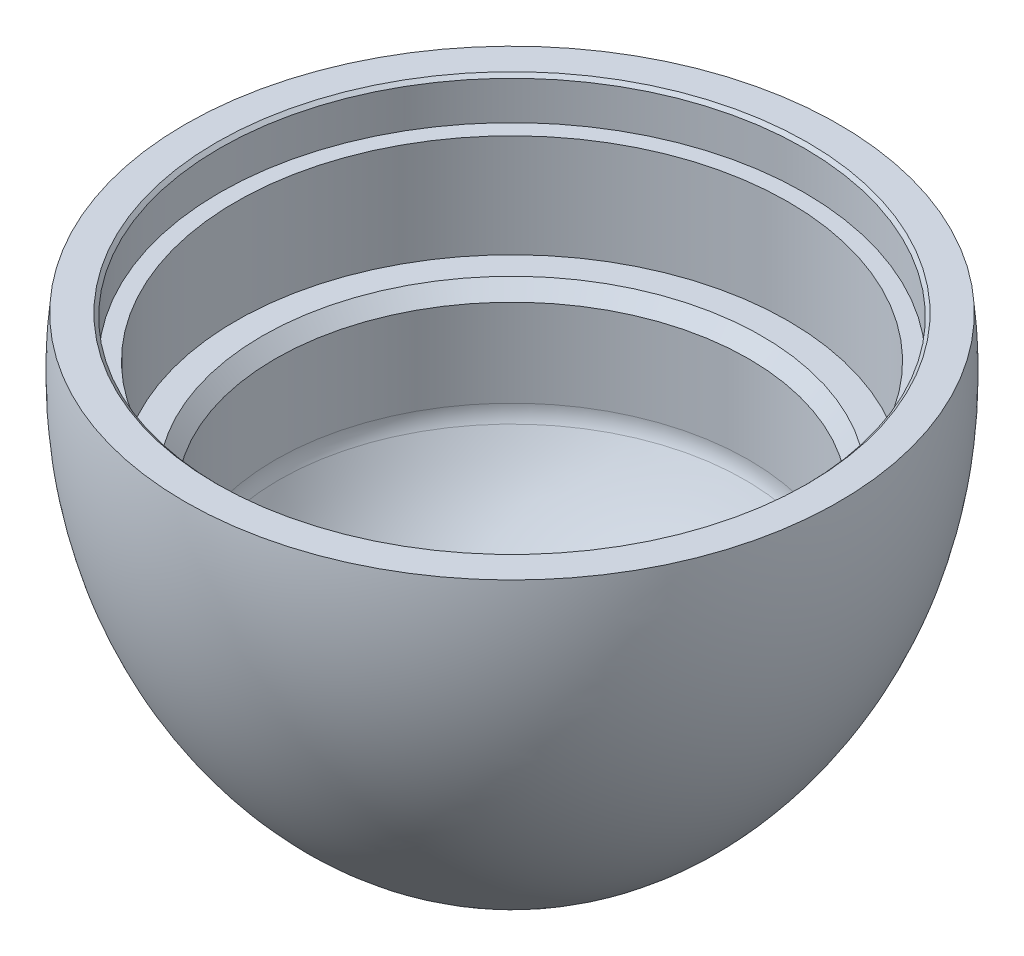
ISO-10303-21;
HEADER;
FILE_DESCRIPTION(('STEP AP214'),'2;1');
FILE_NAME('part.step','',(''),(''),'','','');
FILE_SCHEMA(('AUTOMOTIVE_DESIGN { 1 0 10303 214 1 1 1 1 }'));
ENDSEC;
DATA;
#1=APPLICATION_CONTEXT('core data for automotive mechanical design processes');
#2=APPLICATION_PROTOCOL_DEFINITION('international standard','automotive_design',2000,#1);
#3=PRODUCT_CONTEXT('',#1,'mechanical');
#4=PRODUCT('Part','Part','',(#3));
#5=PRODUCT_RELATED_PRODUCT_CATEGORY('part','',(#4));
#6=PRODUCT_DEFINITION_FORMATION('','',#4);
#7=PRODUCT_DEFINITION_CONTEXT('part definition',#1,'design');
#8=PRODUCT_DEFINITION('design','',#6,#7);
#9=PRODUCT_DEFINITION_SHAPE('','',#8);
#10=(LENGTH_UNIT() NAMED_UNIT(*) SI_UNIT(.MILLI.,.METRE.));
#11=(NAMED_UNIT(*) PLANE_ANGLE_UNIT() SI_UNIT($,.RADIAN.));
#12=(NAMED_UNIT(*) SI_UNIT($,.STERADIAN.) SOLID_ANGLE_UNIT());
#13=UNCERTAINTY_MEASURE_WITH_UNIT(LENGTH_MEASURE(1.E-05),#10,'distance_accuracy_value','');
#14=(GEOMETRIC_REPRESENTATION_CONTEXT(3) GLOBAL_UNCERTAINTY_ASSIGNED_CONTEXT((#13)) GLOBAL_UNIT_ASSIGNED_CONTEXT((#10,
#11,#12)) REPRESENTATION_CONTEXT('',''));
#15=CARTESIAN_POINT('',(0.,0.,0.));
#16=DIRECTION('',(0.,0.,1.));
#17=DIRECTION('',(1.,0.,0.));
#18=AXIS2_PLACEMENT_3D('',#15,#16,#17);
#19=CARTESIAN_POINT('',(0.,-72.41296971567,-0.000217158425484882));
#20=DIRECTION('',(0.,1.,0.));
#21=DIRECTION('',(0.,0.,1.));
#22=AXIS2_PLACEMENT_3D('',#19,#20,#21);
#23=CYLINDRICAL_SURFACE('',#22,21.);
#24=CARTESIAN_POINT('',(0.,-3.175,-0.000217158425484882));
#25=DIRECTION('',(0.,-1.,0.));
#26=DIRECTION('',(0.,0.,-1.));
#27=AXIS2_PLACEMENT_3D('',#24,#25,#26);
#28=CIRCLE('',#27,21.);
#29=CARTESIAN_POINT('',(0.,-3.175,-21.0002171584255));
#30=VERTEX_POINT('',#29);
#31=EDGE_CURVE('E76',#30,#30,#28,.F.);
#32=ORIENTED_EDGE('',*,*,#31,.T.);
#33=EDGE_LOOP('',(#32));
#34=FACE_BOUND('',#33,.T.);
#35=CARTESIAN_POINT('',(0.,-11.008000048,-0.000217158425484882));
#36=DIRECTION('',(0.,1.,0.));
#37=DIRECTION('',(0.,0.,1.));
#38=AXIS2_PLACEMENT_3D('',#35,#36,#37);
#39=CIRCLE('',#38,21.);
#40=CARTESIAN_POINT('',(0.,-11.008000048,20.9997828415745));
#41=VERTEX_POINT('',#40);
#42=EDGE_CURVE('E70',#41,#41,#39,.F.);
#43=ORIENTED_EDGE('',*,*,#42,.T.);
#44=EDGE_LOOP('',(#43));
#45=FACE_BOUND('',#44,.T.);
#46=ADVANCED_FACE('F49',(#34,#45),#23,.F.);
#47=CARTESIAN_POINT('',(0.,-11.008000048,0.));
#48=DIRECTION('',(0.,1.,0.));
#49=DIRECTION('',(0.,0.,1.));
#50=AXIS2_PLACEMENT_3D('',#47,#48,#49);
#51=PLANE('',#50);
#52=CARTESIAN_POINT('',(0.,-11.008000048,0.));
#53=DIRECTION('',(0.,1.,0.));
#54=DIRECTION('',(0.,0.,1.));
#55=AXIS2_PLACEMENT_3D('',#52,#53,#54);
#56=CIRCLE('',#55,19.);
#57=CARTESIAN_POINT('',(0.,-11.008000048,19.));
#58=VERTEX_POINT('',#57);
#59=EDGE_CURVE('E73',#58,#58,#56,.F.);
#60=ORIENTED_EDGE('',*,*,#59,.T.);
#61=EDGE_LOOP('',(#60));
#62=FACE_BOUND('',#61,.T.);
#63=ORIENTED_EDGE('',*,*,#42,.F.);
#64=EDGE_LOOP('',(#63));
#65=FACE_BOUND('',#64,.T.);
#66=ADVANCED_FACE('F114',(#62,#65),#51,.T.);
#67=CARTESIAN_POINT('',(0.,-31.328000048,0.));
#68=DIRECTION('',(0.,-1.,0.));
#69=DIRECTION('',(1.,0.,0.));
#70=AXIS2_PLACEMENT_3D('',#67,#68,#69);
#71=PLANE('',#70);
#72=CARTESIAN_POINT('',(0.,-31.328000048,0.));
#73=DIRECTION('',(0.,-1.,0.));
#74=DIRECTION('',(1.,0.,0.));
#75=AXIS2_PLACEMENT_3D('',#72,#73,#74);
#76=CIRCLE('',#75,5.86616805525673);
#77=CARTESIAN_POINT('',(5.86616805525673,-31.328000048,0.));
#78=VERTEX_POINT('',#77);
#79=EDGE_CURVE('E88',#78,#78,#76,.F.);
#80=ORIENTED_EDGE('',*,*,#79,.T.);
#81=EDGE_LOOP('',(#80));
#82=FACE_BOUND('',#81,.T.);
#83=ADVANCED_FACE('F120',(#82),#71,.F.);
#84=CARTESIAN_POINT('',(0.,0.,0.));
#85=DIRECTION('',(0.,1.,0.));
#86=DIRECTION('',(-1.,0.,0.));
#87=AXIS2_PLACEMENT_3D('',#84,#85,#86);
#88=CYLINDRICAL_SURFACE('',#87,18.);
#89=CARTESIAN_POINT('',(0.,-18.6582076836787,0.));
#90=DIRECTION('',(0.,1.,0.));
#91=DIRECTION('',(-1.,0.,0.));
#92=AXIS2_PLACEMENT_3D('',#89,#90,#91);
#93=CIRCLE('',#92,18.);
#94=CARTESIAN_POINT('',(-18.,-18.6582076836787,0.));
#95=VERTEX_POINT('',#94);
#96=EDGE_CURVE('E97',#95,#95,#93,.F.);
#97=ORIENTED_EDGE('',*,*,#96,.T.);
#98=EDGE_LOOP('',(#97));
#99=FACE_BOUND('',#98,.T.);
#100=CARTESIAN_POINT('',(0.,-12.008000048,0.));
#101=DIRECTION('',(0.,1.,0.));
#102=DIRECTION('',(-1.,0.,0.));
#103=AXIS2_PLACEMENT_3D('',#100,#101,#102);
#104=CIRCLE('',#103,18.);
#105=CARTESIAN_POINT('',(-18.,-12.008000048,0.));
#106=VERTEX_POINT('',#105);
#107=EDGE_CURVE('E69',#106,#106,#104,.T.);
#108=ORIENTED_EDGE('',*,*,#107,.T.);
#109=EDGE_LOOP('',(#108));
#110=FACE_BOUND('',#109,.T.);
#111=ADVANCED_FACE('F142',(#99,#110),#88,.F.);
#112=CARTESIAN_POINT('',(-18.,-19.2702737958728,0.));
#113=CARTESIAN_POINT('',(-16.1830574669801,-22.8809160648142,0.));
#114=CARTESIAN_POINT('',(-14.257330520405,-25.1788176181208,0.));
#115=CARTESIAN_POINT('',(-7.84861420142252,-30.8462309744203,0.));
#116=CARTESIAN_POINT('',(-6.35,-31.328000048,0.));
#117=B_SPLINE_CURVE_WITH_KNOTS('',3,(#112,#113,#114,#115,#116),.UNSPECIFIED.,.F.,.F.,(4,1,4),
(0.191160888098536,0.55885345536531,0.707021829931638),.UNSPECIFIED.);
#118=CARTESIAN_POINT('',(0.,0.,0.));
#119=DIRECTION('',(0.,1.,0.));
#120=AXIS1_PLACEMENT('',#118,#119);
#121=SURFACE_OF_REVOLUTION('',#117,#120);
#122=CARTESIAN_POINT('',(0.,-31.0732392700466,0.));
#123=DIRECTION('',(0.,1.,0.));
#124=DIRECTION('',(-1.,0.,0.));
#125=AXIS2_PLACEMENT_3D('',#122,#123,#124);
#126=CIRCLE('',#125,6.97489782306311);
#127=CARTESIAN_POINT('',(-6.97489782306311,-31.0732392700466,0.));
#128=VERTEX_POINT('',#127);
#129=EDGE_CURVE('E94',#128,#128,#126,.F.);
#130=ORIENTED_EDGE('',*,*,#129,.T.);
#131=EDGE_LOOP('',(#130));
#132=FACE_BOUND('',#131,.T.);
#133=CARTESIAN_POINT('',(0.,-19.8320000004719,0.));
#134=DIRECTION('',(0.,1.,0.));
#135=DIRECTION('',(-1.,0.,0.));
#136=AXIS2_PLACEMENT_3D('',#133,#134,#135);
#137=CIRCLE('',#136,17.7125122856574);
#138=CARTESIAN_POINT('',(-17.7125122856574,-19.8320000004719,0.));
#139=VERTEX_POINT('',#138);
#140=EDGE_CURVE('E91',#139,#139,#137,.T.);
#141=ORIENTED_EDGE('',*,*,#140,.T.);
#142=EDGE_LOOP('',(#141));
#143=FACE_BOUND('',#142,.T.);
#144=ADVANCED_FACE('F146',(#132,#143),#121,.T.);
#145=CARTESIAN_POINT('',(0.,-3.175,22.225));
#146=DIRECTION('',(0.,-1.,0.));
#147=DIRECTION('',(0.,0.,-1.));
#148=AXIS2_PLACEMENT_3D('',#145,#146,#147);
#149=PLANE('',#148);
#150=CARTESIAN_POINT('',(0.,-3.175,0.));
#151=DIRECTION('',(0.,1.,0.));
#152=DIRECTION('',(0.,0.,1.));
#153=AXIS2_PLACEMENT_3D('',#150,#151,#152);
#154=CIRCLE('',#153,22.225);
#155=CARTESIAN_POINT('',(0.,-3.175,22.225));
#156=VERTEX_POINT('',#155);
#157=EDGE_CURVE('E84',#156,#156,#154,.T.);
#158=ORIENTED_EDGE('',*,*,#157,.T.);
#159=EDGE_LOOP('',(#158));
#160=FACE_BOUND('',#159,.T.);
#161=ORIENTED_EDGE('',*,*,#31,.F.);
#162=EDGE_LOOP('',(#161));
#163=FACE_BOUND('',#162,.T.);
#164=ADVANCED_FACE('F153',(#160,#163),#149,.F.);
#165=CARTESIAN_POINT('',(0.,0.,0.));
#166=DIRECTION('',(0.,1.,0.));
#167=DIRECTION('',(0.,0.,1.));
#168=AXIS2_PLACEMENT_3D('',#165,#166,#167);
#169=CYLINDRICAL_SURFACE('',#168,22.225);
#170=CARTESIAN_POINT('',(0.,-0.253999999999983,0.));
#171=DIRECTION('',(0.,1.,0.));
#172=DIRECTION('',(0.,0.,1.));
#173=AXIS2_PLACEMENT_3D('',#170,#171,#172);
#174=CIRCLE('',#173,22.225);
#175=CARTESIAN_POINT('',(0.,-0.253999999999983,22.225));
#176=VERTEX_POINT('',#175);
#177=EDGE_CURVE('E56',#176,#176,#174,.T.);
#178=ORIENTED_EDGE('',*,*,#177,.T.);
#179=EDGE_LOOP('',(#178));
#180=FACE_BOUND('',#179,.T.);
#181=ORIENTED_EDGE('',*,*,#157,.F.);
#182=EDGE_LOOP('',(#181));
#183=FACE_BOUND('',#182,.T.);
#184=ADVANCED_FACE('F63',(#180,#183),#169,.F.);
#185=CARTESIAN_POINT('',(0.,34.942963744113,-0.000217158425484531));
#186=CARTESIAN_POINT('',(-2.47002074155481,34.942963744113,-0.000217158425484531));
#187=CARTESIAN_POINT('',(-8.1811993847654,33.2171120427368,-0.000217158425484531));
#188=CARTESIAN_POINT('',(-15.9799569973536,25.0760591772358,-0.000217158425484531));
#189=CARTESIAN_POINT('',(-20.1961269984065,17.6638092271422,-0.000217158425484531));
#190=CARTESIAN_POINT('',(-26.4159810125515,-0.462030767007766,-0.000217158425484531));
#191=CARTESIAN_POINT('',(-23.3812586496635,-22.2961421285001,-0.000217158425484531));
#192=CARTESIAN_POINT('',(-9.55475702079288,-34.8978097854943,-0.000217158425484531));
#193=CARTESIAN_POINT('',(0.,-34.551436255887,-0.000217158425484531));
#194=B_SPLINE_CURVE_WITH_KNOTS('',3,(#185,#186,#187,#188,#189,#190,#191,#192,#193),
.UNSPECIFIED.,.F.,.F.,(4,1,1,1,1,1,4),(0.,0.0971267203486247,0.127738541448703,
0.306118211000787,0.478065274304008,0.702770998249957,1.),.UNSPECIFIED.);
#195=CARTESIAN_POINT('',(0.,61.3915939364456,-0.000217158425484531));
#196=DIRECTION('',(0.,1.,0.));
#197=AXIS1_PLACEMENT('',#195,#196);
#198=SURFACE_OF_REVOLUTION('',#194,#197);
#199=CARTESIAN_POINT('',(0.,-34.551436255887,-0.000217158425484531));
#200=VERTEX_POINT('',#199);
#201=VERTEX_LOOP('',#200);
#202=FACE_BOUND('',#201,.T.);
#203=CARTESIAN_POINT('',(0.,0.,-0.000217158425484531));
#204=DIRECTION('',(0.,1.,0.));
#205=DIRECTION('',(0.,0.,1.));
#206=AXIS2_PLACEMENT_3D('',#203,#204,#205);
#207=CIRCLE('',#206,24.8562743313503);
#208=CARTESIAN_POINT('',(0.,0.,24.8560571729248));
#209=VERTEX_POINT('',#208);
#210=EDGE_CURVE('E67',#209,#209,#207,.F.);
#211=ORIENTED_EDGE('',*,*,#210,.T.);
#212=EDGE_LOOP('',(#211));
#213=FACE_BOUND('',#212,.T.);
#214=ADVANCED_FACE('F59',(#202,#213),#198,.F.);
#215=CARTESIAN_POINT('',(0.,0.,0.));
#216=DIRECTION('',(0.,1.,0.));
#217=DIRECTION('',(0.,0.,1.));
#218=AXIS2_PLACEMENT_3D('',#215,#216,#217);
#219=PLANE('',#218);
#220=CARTESIAN_POINT('',(0.,0.,0.));
#221=DIRECTION('',(0.,1.,0.));
#222=DIRECTION('',(0.,0.,1.));
#223=AXIS2_PLACEMENT_3D('',#220,#221,#222);
#224=CIRCLE('',#223,22.479);
#225=CARTESIAN_POINT('',(0.,0.,22.479));
#226=VERTEX_POINT('',#225);
#227=EDGE_CURVE('E14',#226,#226,#224,.F.);
#228=ORIENTED_EDGE('',*,*,#227,.T.);
#229=EDGE_LOOP('',(#228));
#230=FACE_BOUND('',#229,.T.);
#231=ORIENTED_EDGE('',*,*,#210,.F.);
#232=EDGE_LOOP('',(#231));
#233=FACE_BOUND('',#232,.T.);
#234=ADVANCED_FACE('F62',(#230,#233),#219,.T.);
#235=CARTESIAN_POINT('',(0.,-12.008000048,0.));
#236=DIRECTION('',(0.,1.,0.));
#237=DIRECTION('',(-1.,0.,0.));
#238=AXIS2_PLACEMENT_3D('',#235,#236,#237);
#239=CONICAL_SURFACE('',#238,18.,0.785398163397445);
#240=ORIENTED_EDGE('',*,*,#59,.F.);
#241=EDGE_LOOP('',(#240));
#242=FACE_BOUND('',#241,.T.);
#243=ORIENTED_EDGE('',*,*,#107,.F.);
#244=EDGE_LOOP('',(#243));
#245=FACE_BOUND('',#244,.T.);
#246=ADVANCED_FACE('F127',(#242,#245),#239,.F.);
#247=CARTESIAN_POINT('',(0.,-28.788000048,0.));
#248=DIRECTION('',(0.,1.,0.));
#249=DIRECTION('',(-1.,0.,0.));
#250=AXIS2_PLACEMENT_3D('',#247,#248,#249);
#251=TOROIDAL_SURFACE('',#250,5.86616805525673,2.54);
#252=ORIENTED_EDGE('',*,*,#129,.F.);
#253=EDGE_LOOP('',(#252));
#254=FACE_BOUND('',#253,.T.);
#255=ORIENTED_EDGE('',*,*,#79,.F.);
#256=EDGE_LOOP('',(#255));
#257=FACE_BOUND('',#256,.T.);
#258=ADVANCED_FACE('F110',(#254,#257),#251,.F.);
#259=CARTESIAN_POINT('',(0.,-18.6582076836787,0.));
#260=DIRECTION('',(0.,1.,0.));
#261=DIRECTION('',(-1.,0.,0.));
#262=AXIS2_PLACEMENT_3D('',#259,#260,#261);
#263=TOROIDAL_SURFACE('',#262,15.46,2.54);
#264=ORIENTED_EDGE('',*,*,#96,.F.);
#265=EDGE_LOOP('',(#264));
#266=FACE_BOUND('',#265,.T.);
#267=ORIENTED_EDGE('',*,*,#140,.F.);
#268=EDGE_LOOP('',(#267));
#269=FACE_BOUND('',#268,.T.);
#270=ADVANCED_FACE('F105',(#266,#269),#263,.F.);
#271=CARTESIAN_POINT('',(0.,-0.253999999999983,0.));
#272=DIRECTION('',(0.,1.,0.));
#273=DIRECTION('',(0.,0.,1.));
#274=AXIS2_PLACEMENT_3D('',#271,#272,#273);
#275=CONICAL_SURFACE('',#274,22.225,0.785398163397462);
#276=ORIENTED_EDGE('',*,*,#227,.F.);
#277=EDGE_LOOP('',(#276));
#278=FACE_BOUND('',#277,.T.);
#279=ORIENTED_EDGE('',*,*,#177,.F.);
#280=EDGE_LOOP('',(#279));
#281=FACE_BOUND('',#280,.T.);
#282=ADVANCED_FACE('F51',(#278,#281),#275,.F.);
#283=CLOSED_SHELL('',(#46,#66,#83,#111,#144,#164,#184,#214,#234,#246,#258,#270,#282));
#284=MANIFOLD_SOLID_BREP('B2',#283);
#285=ADVANCED_BREP_SHAPE_REPRESENTATION('',(#18,#284),#14);
#286=SHAPE_DEFINITION_REPRESENTATION(#9,#285);
ENDSEC;
END-ISO-10303-21;
